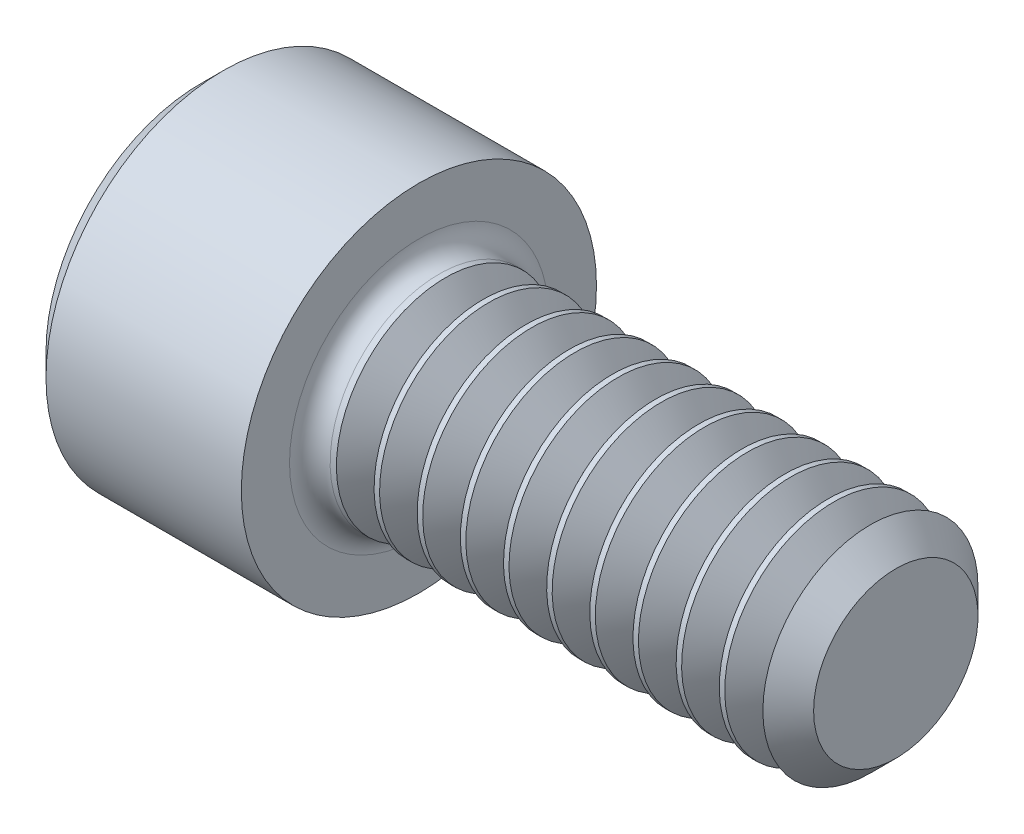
from build123d import *

# Parameters (mm, degrees)
FILLET1_R       = 0.2032
HEX_2_DEPTH     = 0.9652
THDSCHPAT_COUNT = 10
THDSCHPAT_PITCH = 0.432054


with BuildPart() as part:
    # BodySke → Base-Revolve (revolve)
    with BuildSketch(Plane.XY, mode=Mode.PRIVATE) as base_revolve_sk:
        Polygon((0, 0), (0, 1.5494), (0.2286, 1.778), (2.1844, 1.778), (2.1844, 1.0922), (6.69036, 1.0922), (6.9596, 0.82296), (6.9596, 0), align=None)
    revolve(base_revolve_sk.sketch.rotate(Axis((-31.75, 0, 0), (1, 0, 0)), 90), axis=Axis((-31.75, 0, 0), (1, 0, 0)))

    # Fillet1
    fillet1_edges = [part.edges().sort_by_distance(p)[0] for p in [
        (2.1844, 0, -1.0922),
    ]]
    fillet(fillet1_edges, radius=FILLET1_R)

    # Sketch2 → Hex-PreBroach (revolve, cut)
    with BuildSketch(Plane.XY, mode=Mode.PRIVATE) as hex_prebroach_sk:
        Polygon((0, 0.9906), (0.9652, 0.9906), (1.537123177, 0), (0, 0), align=None)
    revolve(hex_prebroach_sk.sketch.rotate(Axis((0, 0, 0), (1, 0, 0)), 90), axis=Axis((0, 0, 0), (1, 0, 0)), mode=Mode.SUBTRACT)

    # Sketch3 → Hex 2 (cut)
    with BuildSketch(Plane(origin=(0, 0, 0), x_dir=(0, 0.500000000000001, 0.866025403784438), z_dir=(-1, 0, 0))):
        Polygon((0.571923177, 0.9906), (-0.571923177, 0.9906), (-1.143846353, 0), (-0.571923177, -0.9906), (0.571923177, -0.9906), (1.143846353, 0), align=None)
    extrude(amount=-HEX_2_DEPTH, mode=Mode.SUBTRACT)

    # ThdSchSke → ThreadSchematic (revolve, cut)
    with BuildSketch(Plane.XY):
        Polygon((2.63906, -0.82296), (2.450536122, -1.0922), (2.450536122, -1.36525), (2.827583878, -1.36525), (2.827583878, -1.0922), align=None)
    threadschematic = revolve(axis=Axis((-3.175, 0, 0), (1, 0, 0)), mode=Mode.SUBTRACT)

    # ThdSchPat: ThreadSchematic ×10
    with Locations(*[(i * THDSCHPAT_PITCH, 0, 0) for i in range(1, THDSCHPAT_COUNT)]):
        add(threadschematic, mode=Mode.SUBTRACT)


solid = part.part
